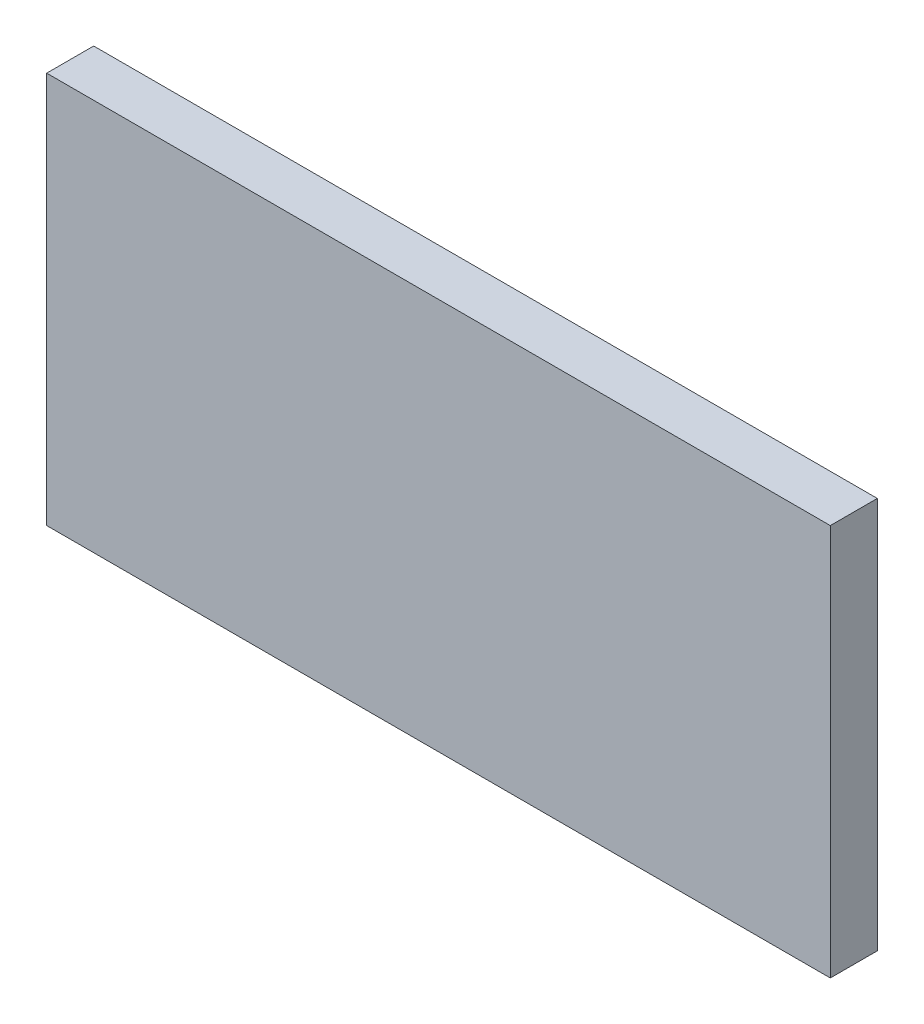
from build123d import *

# Parameters (mm, degrees)
SKETCH1_W      = 50
SKETCH1_H      = 25
EXTRUDE1_DEPTH = 3


with BuildPart() as part:
    # Sketch1 → Extrude1 (new body)
    with BuildSketch(Plane.XY):
        with Locations((25, 12.5)):
            Rectangle(SKETCH1_W, SKETCH1_H)
    extrude(amount=EXTRUDE1_DEPTH)


solid = part.part
